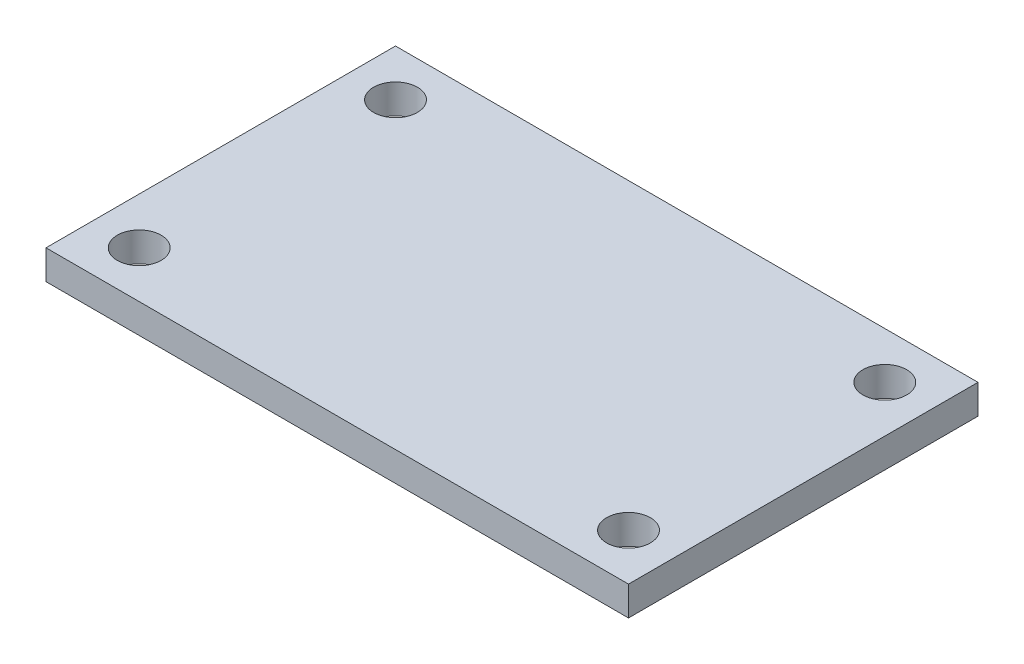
ISO-10303-21;
HEADER;
FILE_DESCRIPTION(('STEP AP214'),'2;1');
FILE_NAME('part.step','',(''),(''),'','','');
FILE_SCHEMA(('AUTOMOTIVE_DESIGN { 1 0 10303 214 1 1 1 1 }'));
ENDSEC;
DATA;
#1=APPLICATION_CONTEXT('core data for automotive mechanical design processes');
#2=APPLICATION_PROTOCOL_DEFINITION('international standard','automotive_design',2000,#1);
#3=PRODUCT_CONTEXT('',#1,'mechanical');
#4=PRODUCT('Part','Part','',(#3));
#5=PRODUCT_RELATED_PRODUCT_CATEGORY('part','',(#4));
#6=PRODUCT_DEFINITION_FORMATION('','',#4);
#7=PRODUCT_DEFINITION_CONTEXT('part definition',#1,'design');
#8=PRODUCT_DEFINITION('design','',#6,#7);
#9=PRODUCT_DEFINITION_SHAPE('','',#8);
#10=(LENGTH_UNIT() NAMED_UNIT(*) SI_UNIT(.MILLI.,.METRE.));
#11=(NAMED_UNIT(*) PLANE_ANGLE_UNIT() SI_UNIT($,.RADIAN.));
#12=(NAMED_UNIT(*) SI_UNIT($,.STERADIAN.) SOLID_ANGLE_UNIT());
#13=UNCERTAINTY_MEASURE_WITH_UNIT(LENGTH_MEASURE(1.E-05),#10,'distance_accuracy_value','');
#14=(GEOMETRIC_REPRESENTATION_CONTEXT(3) GLOBAL_UNCERTAINTY_ASSIGNED_CONTEXT((#13)) GLOBAL_UNIT_ASSIGNED_CONTEXT((#10,
#11,#12)) REPRESENTATION_CONTEXT('',''));
#15=CARTESIAN_POINT('',(0.,0.,0.));
#16=DIRECTION('',(0.,0.,1.));
#17=DIRECTION('',(1.,0.,0.));
#18=AXIS2_PLACEMENT_3D('',#15,#16,#17);
#19=CARTESIAN_POINT('',(0.,1.6,0.));
#20=DIRECTION('',(0.,-1.,0.));
#21=DIRECTION('',(0.,0.,-1.));
#22=AXIS2_PLACEMENT_3D('',#19,#20,#21);
#23=PLANE('',#22);
#24=DIRECTION('',(0.,0.,-1.));
#25=VECTOR('',#24,1.);
#26=CARTESIAN_POINT('',(15.875,1.6,9.525));
#27=LINE('',#26,#25);
#28=CARTESIAN_POINT('',(15.875,1.6,9.525));
#29=VERTEX_POINT('',#28);
#30=CARTESIAN_POINT('',(15.875,1.6,-9.525));
#31=VERTEX_POINT('',#30);
#32=EDGE_CURVE('E92',#29,#31,#27,.T.);
#33=ORIENTED_EDGE('',*,*,#32,.T.);
#34=DIRECTION('',(-1.,0.,0.));
#35=VECTOR('',#34,1.);
#36=CARTESIAN_POINT('',(-15.875,1.6,-9.525));
#37=LINE('',#36,#35);
#38=CARTESIAN_POINT('',(-15.875,1.6,-9.525));
#39=VERTEX_POINT('',#38);
#40=EDGE_CURVE('E87',#31,#39,#37,.T.);
#41=ORIENTED_EDGE('',*,*,#40,.T.);
#42=DIRECTION('',(0.,0.,1.));
#43=VECTOR('',#42,1.);
#44=CARTESIAN_POINT('',(-15.875,1.6,9.525));
#45=LINE('',#44,#43);
#46=CARTESIAN_POINT('',(-15.875,1.6,9.525));
#47=VERTEX_POINT('',#46);
#48=EDGE_CURVE('E90',#39,#47,#45,.T.);
#49=ORIENTED_EDGE('',*,*,#48,.T.);
#50=DIRECTION('',(1.,0.,0.));
#51=VECTOR('',#50,1.);
#52=CARTESIAN_POINT('',(-15.875,1.6,9.525));
#53=LINE('',#52,#51);
#54=EDGE_CURVE('E57',#47,#29,#53,.T.);
#55=ORIENTED_EDGE('',*,*,#54,.T.);
#56=EDGE_LOOP('',(#33,#41,#49,#55));
#57=FACE_BOUND('',#56,.T.);
#58=CARTESIAN_POINT('',(13.335,1.6,-6.985));
#59=DIRECTION('',(0.,1.,0.));
#60=DIRECTION('',(0.,0.,1.));
#61=AXIS2_PLACEMENT_3D('',#58,#59,#60);
#62=CIRCLE('',#61,1.1938);
#63=CARTESIAN_POINT('',(13.335,1.6,-5.79119999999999));
#64=VERTEX_POINT('',#63);
#65=EDGE_CURVE('E112',#64,#64,#62,.T.);
#66=ORIENTED_EDGE('',*,*,#65,.F.);
#67=EDGE_LOOP('',(#66));
#68=FACE_BOUND('',#67,.T.);
#69=CARTESIAN_POINT('',(13.335,1.6,6.985));
#70=DIRECTION('',(0.,1.,0.));
#71=DIRECTION('',(0.,0.,1.));
#72=AXIS2_PLACEMENT_3D('',#69,#70,#71);
#73=CIRCLE('',#72,1.1938);
#74=CARTESIAN_POINT('',(13.335,1.6,8.1788));
#75=VERTEX_POINT('',#74);
#76=EDGE_CURVE('E134',#75,#75,#73,.T.);
#77=ORIENTED_EDGE('',*,*,#76,.F.);
#78=EDGE_LOOP('',(#77));
#79=FACE_BOUND('',#78,.T.);
#80=CARTESIAN_POINT('',(-13.335,1.6,6.985));
#81=DIRECTION('',(0.,1.,0.));
#82=DIRECTION('',(0.,0.,1.));
#83=AXIS2_PLACEMENT_3D('',#80,#81,#82);
#84=CIRCLE('',#83,1.1938);
#85=CARTESIAN_POINT('',(-13.335,1.6,8.1788));
#86=VERTEX_POINT('',#85);
#87=EDGE_CURVE('E142',#86,#86,#84,.T.);
#88=ORIENTED_EDGE('',*,*,#87,.F.);
#89=EDGE_LOOP('',(#88));
#90=FACE_BOUND('',#89,.T.);
#91=CARTESIAN_POINT('',(-13.335,1.6,-6.985));
#92=DIRECTION('',(0.,1.,0.));
#93=DIRECTION('',(0.,0.,1.));
#94=AXIS2_PLACEMENT_3D('',#91,#92,#93);
#95=CIRCLE('',#94,1.1938);
#96=CARTESIAN_POINT('',(-13.335,1.6,-5.79119999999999));
#97=VERTEX_POINT('',#96);
#98=EDGE_CURVE('E150',#97,#97,#95,.T.);
#99=ORIENTED_EDGE('',*,*,#98,.F.);
#100=EDGE_LOOP('',(#99));
#101=FACE_BOUND('',#100,.T.);
#102=ADVANCED_FACE('F39',(#57,#68,#79,#90,#101),#23,.F.);
#103=CARTESIAN_POINT('',(0.,0.,0.));
#104=DIRECTION('',(0.,-1.,0.));
#105=DIRECTION('',(0.,0.,-1.));
#106=AXIS2_PLACEMENT_3D('',#103,#104,#105);
#107=PLANE('',#106);
#108=CARTESIAN_POINT('',(-13.335,0.,6.985));
#109=DIRECTION('',(0.,1.,0.));
#110=DIRECTION('',(0.,0.,1.));
#111=AXIS2_PLACEMENT_3D('',#108,#109,#110);
#112=CIRCLE('',#111,1.1938);
#113=CARTESIAN_POINT('',(-13.335,0.,8.1788));
#114=VERTEX_POINT('',#113);
#115=EDGE_CURVE('E146',#114,#114,#112,.T.);
#116=ORIENTED_EDGE('',*,*,#115,.T.);
#117=EDGE_LOOP('',(#116));
#118=FACE_BOUND('',#117,.T.);
#119=CARTESIAN_POINT('',(13.335,0.,-6.985));
#120=DIRECTION('',(0.,1.,0.));
#121=DIRECTION('',(0.,0.,1.));
#122=AXIS2_PLACEMENT_3D('',#119,#120,#121);
#123=CIRCLE('',#122,1.1938);
#124=CARTESIAN_POINT('',(13.335,0.,-5.79119999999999));
#125=VERTEX_POINT('',#124);
#126=EDGE_CURVE('E130',#125,#125,#123,.T.);
#127=ORIENTED_EDGE('',*,*,#126,.T.);
#128=EDGE_LOOP('',(#127));
#129=FACE_BOUND('',#128,.T.);
#130=DIRECTION('',(0.,0.,-1.));
#131=VECTOR('',#130,1.);
#132=CARTESIAN_POINT('',(15.875,0.,9.525));
#133=LINE('',#132,#131);
#134=CARTESIAN_POINT('',(15.875,0.,9.525));
#135=VERTEX_POINT('',#134);
#136=CARTESIAN_POINT('',(15.875,0.,-9.525));
#137=VERTEX_POINT('',#136);
#138=EDGE_CURVE('E108',#135,#137,#133,.T.);
#139=ORIENTED_EDGE('',*,*,#138,.F.);
#140=DIRECTION('',(1.,0.,0.));
#141=VECTOR('',#140,1.);
#142=CARTESIAN_POINT('',(-15.875,0.,9.525));
#143=LINE('',#142,#141);
#144=CARTESIAN_POINT('',(-15.875,0.,9.525));
#145=VERTEX_POINT('',#144);
#146=EDGE_CURVE('E80',#145,#135,#143,.T.);
#147=ORIENTED_EDGE('',*,*,#146,.F.);
#148=DIRECTION('',(0.,0.,1.));
#149=VECTOR('',#148,1.);
#150=CARTESIAN_POINT('',(-15.875,0.,9.525));
#151=LINE('',#150,#149);
#152=CARTESIAN_POINT('',(-15.875,0.,-9.525));
#153=VERTEX_POINT('',#152);
#154=EDGE_CURVE('E74',#153,#145,#151,.T.);
#155=ORIENTED_EDGE('',*,*,#154,.F.);
#156=DIRECTION('',(-1.,0.,0.));
#157=VECTOR('',#156,1.);
#158=CARTESIAN_POINT('',(-15.875,0.,-9.525));
#159=LINE('',#158,#157);
#160=EDGE_CURVE('E97',#137,#153,#159,.T.);
#161=ORIENTED_EDGE('',*,*,#160,.F.);
#162=EDGE_LOOP('',(#139,#147,#155,#161));
#163=FACE_BOUND('',#162,.T.);
#164=CARTESIAN_POINT('',(13.335,0.,6.985));
#165=DIRECTION('',(0.,1.,0.));
#166=DIRECTION('',(0.,0.,1.));
#167=AXIS2_PLACEMENT_3D('',#164,#165,#166);
#168=CIRCLE('',#167,1.1938);
#169=CARTESIAN_POINT('',(13.335,0.,8.1788));
#170=VERTEX_POINT('',#169);
#171=EDGE_CURVE('E138',#170,#170,#168,.T.);
#172=ORIENTED_EDGE('',*,*,#171,.T.);
#173=EDGE_LOOP('',(#172));
#174=FACE_BOUND('',#173,.T.);
#175=CARTESIAN_POINT('',(-13.335,0.,-6.985));
#176=DIRECTION('',(0.,1.,0.));
#177=DIRECTION('',(0.,0.,1.));
#178=AXIS2_PLACEMENT_3D('',#175,#176,#177);
#179=CIRCLE('',#178,1.1938);
#180=CARTESIAN_POINT('',(-13.335,0.,-5.79119999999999));
#181=VERTEX_POINT('',#180);
#182=EDGE_CURVE('E154',#181,#181,#179,.T.);
#183=ORIENTED_EDGE('',*,*,#182,.T.);
#184=EDGE_LOOP('',(#183));
#185=FACE_BOUND('',#184,.T.);
#186=ADVANCED_FACE('F125',(#118,#129,#163,#174,#185),#107,.T.);
#187=CARTESIAN_POINT('',(15.875,1.6,9.525));
#188=DIRECTION('',(-1.,0.,0.));
#189=DIRECTION('',(0.,0.,1.));
#190=AXIS2_PLACEMENT_3D('',#187,#188,#189);
#191=PLANE('',#190);
#192=ORIENTED_EDGE('',*,*,#138,.T.);
#193=DIRECTION('',(0.,-1.,0.));
#194=VECTOR('',#193,1.);
#195=CARTESIAN_POINT('',(15.875,1.6,-9.525));
#196=LINE('',#195,#194);
#197=EDGE_CURVE('E11',#31,#137,#196,.T.);
#198=ORIENTED_EDGE('',*,*,#197,.F.);
#199=ORIENTED_EDGE('',*,*,#32,.F.);
#200=DIRECTION('',(0.,-1.,0.));
#201=VECTOR('',#200,1.);
#202=CARTESIAN_POINT('',(15.875,1.6,9.525));
#203=LINE('',#202,#201);
#204=EDGE_CURVE('E104',#29,#135,#203,.T.);
#205=ORIENTED_EDGE('',*,*,#204,.T.);
#206=EDGE_LOOP('',(#192,#198,#199,#205));
#207=FACE_BOUND('',#206,.T.);
#208=ADVANCED_FACE('F41',(#207),#191,.F.);
#209=CARTESIAN_POINT('',(-15.875,1.6,-9.525));
#210=DIRECTION('',(0.,0.,1.));
#211=DIRECTION('',(1.,0.,0.));
#212=AXIS2_PLACEMENT_3D('',#209,#210,#211);
#213=PLANE('',#212);
#214=ORIENTED_EDGE('',*,*,#160,.T.);
#215=DIRECTION('',(0.,-1.,0.));
#216=VECTOR('',#215,1.);
#217=CARTESIAN_POINT('',(-15.875,1.6,-9.525));
#218=LINE('',#217,#216);
#219=EDGE_CURVE('E49',#39,#153,#218,.T.);
#220=ORIENTED_EDGE('',*,*,#219,.F.);
#221=ORIENTED_EDGE('',*,*,#40,.F.);
#222=ORIENTED_EDGE('',*,*,#197,.T.);
#223=EDGE_LOOP('',(#214,#220,#221,#222));
#224=FACE_BOUND('',#223,.T.);
#225=ADVANCED_FACE('F96',(#224),#213,.F.);
#226=CARTESIAN_POINT('',(-15.875,1.6,9.525));
#227=DIRECTION('',(1.,0.,0.));
#228=DIRECTION('',(0.,0.,-1.));
#229=AXIS2_PLACEMENT_3D('',#226,#227,#228);
#230=PLANE('',#229);
#231=ORIENTED_EDGE('',*,*,#154,.T.);
#232=DIRECTION('',(0.,-1.,0.));
#233=VECTOR('',#232,1.);
#234=CARTESIAN_POINT('',(-15.875,1.6,9.525));
#235=LINE('',#234,#233);
#236=EDGE_CURVE('E99',#47,#145,#235,.T.);
#237=ORIENTED_EDGE('',*,*,#236,.F.);
#238=ORIENTED_EDGE('',*,*,#48,.F.);
#239=ORIENTED_EDGE('',*,*,#219,.T.);
#240=EDGE_LOOP('',(#231,#237,#238,#239));
#241=FACE_BOUND('',#240,.T.);
#242=ADVANCED_FACE('F100',(#241),#230,.F.);
#243=CARTESIAN_POINT('',(-15.875,1.6,9.525));
#244=DIRECTION('',(0.,0.,-1.));
#245=DIRECTION('',(-1.,0.,0.));
#246=AXIS2_PLACEMENT_3D('',#243,#244,#245);
#247=PLANE('',#246);
#248=ORIENTED_EDGE('',*,*,#146,.T.);
#249=ORIENTED_EDGE('',*,*,#204,.F.);
#250=ORIENTED_EDGE('',*,*,#54,.F.);
#251=ORIENTED_EDGE('',*,*,#236,.T.);
#252=EDGE_LOOP('',(#248,#249,#250,#251));
#253=FACE_BOUND('',#252,.T.);
#254=ADVANCED_FACE('F122',(#253),#247,.F.);
#255=CARTESIAN_POINT('',(13.335,1.6,-6.985));
#256=DIRECTION('',(0.,-1.,0.));
#257=DIRECTION('',(0.,0.,-1.));
#258=AXIS2_PLACEMENT_3D('',#255,#256,#257);
#259=CYLINDRICAL_SURFACE('',#258,1.1938);
#260=ORIENTED_EDGE('',*,*,#65,.T.);
#261=EDGE_LOOP('',(#260));
#262=FACE_BOUND('',#261,.T.);
#263=ORIENTED_EDGE('',*,*,#126,.F.);
#264=EDGE_LOOP('',(#263));
#265=FACE_BOUND('',#264,.T.);
#266=ADVANCED_FACE('F173',(#262,#265),#259,.F.);
#267=CARTESIAN_POINT('',(13.335,1.6,6.985));
#268=DIRECTION('',(0.,-1.,0.));
#269=DIRECTION('',(0.,0.,-1.));
#270=AXIS2_PLACEMENT_3D('',#267,#268,#269);
#271=CYLINDRICAL_SURFACE('',#270,1.1938);
#272=ORIENTED_EDGE('',*,*,#76,.T.);
#273=EDGE_LOOP('',(#272));
#274=FACE_BOUND('',#273,.T.);
#275=ORIENTED_EDGE('',*,*,#171,.F.);
#276=EDGE_LOOP('',(#275));
#277=FACE_BOUND('',#276,.T.);
#278=ADVANCED_FACE('F219',(#274,#277),#271,.F.);
#279=CARTESIAN_POINT('',(-13.335,1.6,6.985));
#280=DIRECTION('',(0.,-1.,0.));
#281=DIRECTION('',(0.,0.,-1.));
#282=AXIS2_PLACEMENT_3D('',#279,#280,#281);
#283=CYLINDRICAL_SURFACE('',#282,1.1938);
#284=ORIENTED_EDGE('',*,*,#87,.T.);
#285=EDGE_LOOP('',(#284));
#286=FACE_BOUND('',#285,.T.);
#287=ORIENTED_EDGE('',*,*,#115,.F.);
#288=EDGE_LOOP('',(#287));
#289=FACE_BOUND('',#288,.T.);
#290=ADVANCED_FACE('F227',(#286,#289),#283,.F.);
#291=CARTESIAN_POINT('',(-13.335,1.6,-6.985));
#292=DIRECTION('',(0.,-1.,0.));
#293=DIRECTION('',(0.,0.,-1.));
#294=AXIS2_PLACEMENT_3D('',#291,#292,#293);
#295=CYLINDRICAL_SURFACE('',#294,1.1938);
#296=ORIENTED_EDGE('',*,*,#98,.T.);
#297=EDGE_LOOP('',(#296));
#298=FACE_BOUND('',#297,.T.);
#299=ORIENTED_EDGE('',*,*,#182,.F.);
#300=EDGE_LOOP('',(#299));
#301=FACE_BOUND('',#300,.T.);
#302=ADVANCED_FACE('F162',(#298,#301),#295,.F.);
#303=CLOSED_SHELL('',(#102,#186,#208,#225,#242,#254,#266,#278,#290,#302));
#304=MANIFOLD_SOLID_BREP('B2',#303);
#305=ADVANCED_BREP_SHAPE_REPRESENTATION('',(#18,#304),#14);
#306=SHAPE_DEFINITION_REPRESENTATION(#9,#305);
ENDSEC;
END-ISO-10303-21;
